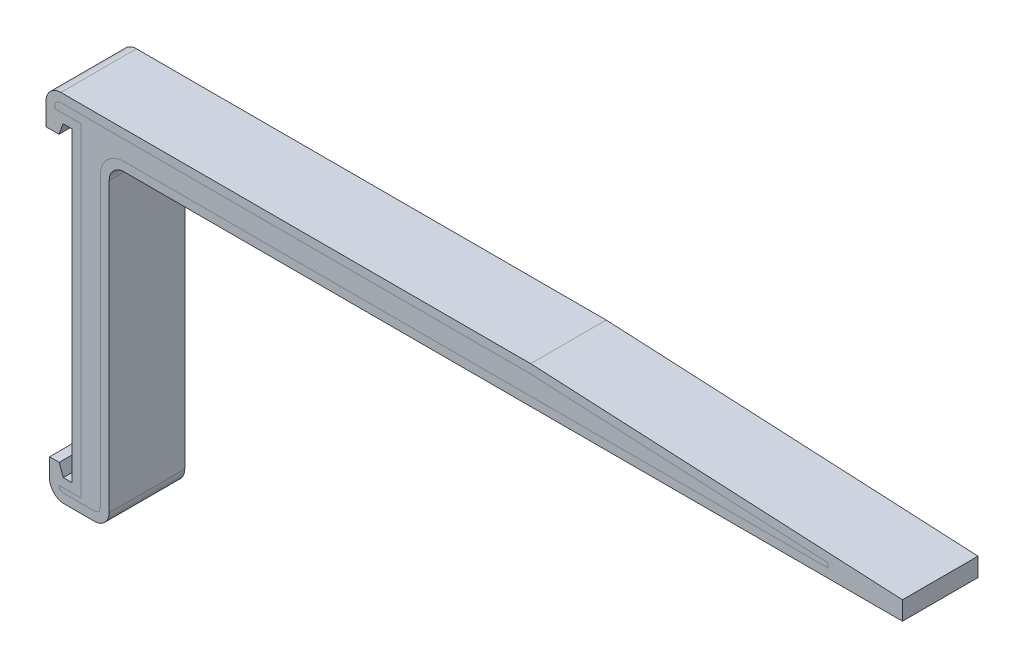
from build123d import *

# Parameters (mm, degrees)
BOSS_EXTRUDE1_DEPTH = 50.8
FILLET1_R           = 20
BOSS_EXTRUDE2_DEPTH = 6.5


with BuildPart() as part:
    # Sketch1 → Boss-Extrude1 (new, symmetric)
    with BuildSketch(Plane.XY):
        Polygon((122.759553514, -8459.375), (117.3, -8444.375), (104.3, -8444.375), (104.3, -8489.375), (184.55, -8489.375), (184.55, -8062.375), (1251.35, -8062.375), (1251.35, -8037.375), (751.35, -8012.375), (99.55, -8012.375), (99.55, -8062.375), (117.05, -8062.375), (122.509553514, -8047.375), (134.55, -8047.375), (134.55, -8459.375), align=None)
    extrude(amount=BOSS_EXTRUDE1_DEPTH, both=True)

    # Fillet1
    fillet1_edges = [part.edges().sort_by_distance(p)[0] for p in [
        (99.55, -8012.375, 0),
        (184.55, -8062.375, 0),
        (184.55, -8489.375, 0),
        (104.3, -8489.375, 0),
    ]]
    fillet(fillet1_edges, radius=FILLET1_R)

    # Sketch3 → Boss-Extrude2 (add, symmetric)
    with BuildSketch(Plane.XY):
        Polygon((134.55, -8459.375), (122.759553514, -8459.375), (119.84779164, -8451.375), (134.55, -8451.375), align=None)
    extrude(amount=BOSS_EXTRUDE2_DEPTH, both=True)


solid = part.part
